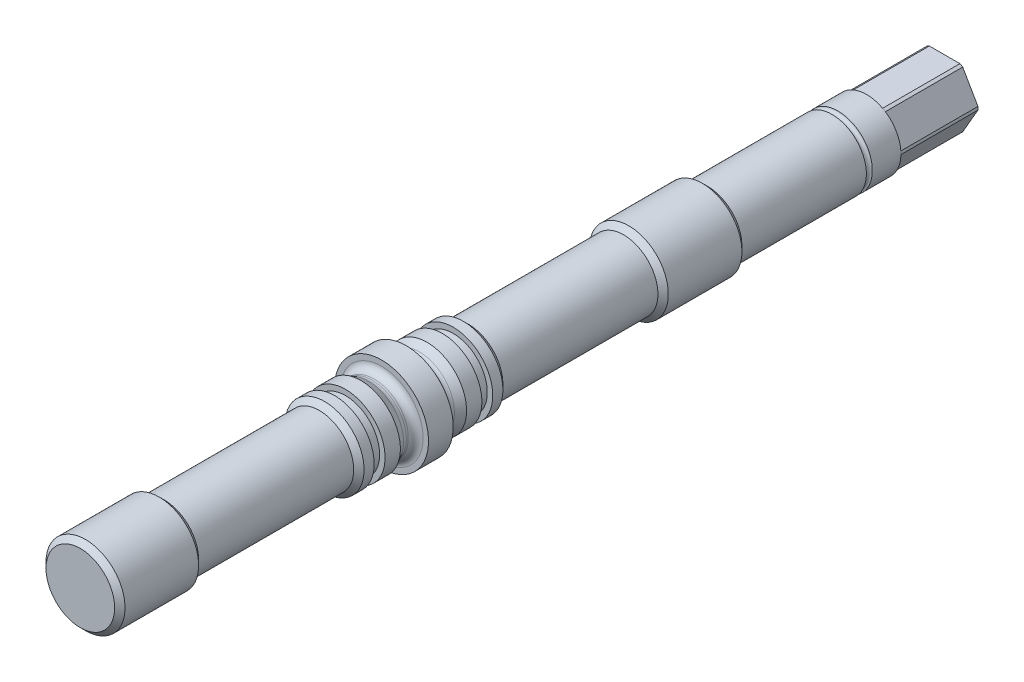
ISO-10303-21;
HEADER;
FILE_DESCRIPTION(('STEP AP214'),'2;1');
FILE_NAME('part.step','',(''),(''),'','','');
FILE_SCHEMA(('AUTOMOTIVE_DESIGN { 1 0 10303 214 1 1 1 1 }'));
ENDSEC;
DATA;
#1=APPLICATION_CONTEXT('core data for automotive mechanical design processes');
#2=APPLICATION_PROTOCOL_DEFINITION('international standard','automotive_design',2000,#1);
#3=PRODUCT_CONTEXT('',#1,'mechanical');
#4=PRODUCT('Part','Part','',(#3));
#5=PRODUCT_RELATED_PRODUCT_CATEGORY('part','',(#4));
#6=PRODUCT_DEFINITION_FORMATION('','',#4);
#7=PRODUCT_DEFINITION_CONTEXT('part definition',#1,'design');
#8=PRODUCT_DEFINITION('design','',#6,#7);
#9=PRODUCT_DEFINITION_SHAPE('','',#8);
#10=(LENGTH_UNIT() NAMED_UNIT(*) SI_UNIT(.MILLI.,.METRE.));
#11=(NAMED_UNIT(*) PLANE_ANGLE_UNIT() SI_UNIT($,.RADIAN.));
#12=(NAMED_UNIT(*) SI_UNIT($,.STERADIAN.) SOLID_ANGLE_UNIT());
#13=UNCERTAINTY_MEASURE_WITH_UNIT(LENGTH_MEASURE(1.E-05),#10,'distance_accuracy_value','');
#14=(GEOMETRIC_REPRESENTATION_CONTEXT(3) GLOBAL_UNCERTAINTY_ASSIGNED_CONTEXT((#13)) GLOBAL_UNIT_ASSIGNED_CONTEXT((#10,
#11,#12)) REPRESENTATION_CONTEXT('',''));
#15=CARTESIAN_POINT('',(0.,0.,0.));
#16=DIRECTION('',(0.,0.,1.));
#17=DIRECTION('',(1.,0.,0.));
#18=AXIS2_PLACEMENT_3D('',#15,#16,#17);
#19=CARTESIAN_POINT('',(0.,0.,-106.478312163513));
#20=DIRECTION('',(0.,0.,-1.));
#21=DIRECTION('',(-1.,0.,0.));
#22=AXIS2_PLACEMENT_3D('',#19,#20,#21);
#23=CYLINDRICAL_SURFACE('',#22,6.75);
#24=DIRECTION('',(0.,0.,-1.));
#25=VECTOR('',#24,1.);
#26=CARTESIAN_POINT('',(-3.09232921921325,-6.,-106.478312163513));
#27=LINE('',#26,#25);
#28=CARTESIAN_POINT('',(-3.09232921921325,-6.,-95.7));
#29=VERTEX_POINT('',#28);
#30=CARTESIAN_POINT('',(-3.09232921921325,-6.,-111.5));
#31=VERTEX_POINT('',#30);
#32=EDGE_CURVE('E294',#29,#31,#27,.T.);
#33=ORIENTED_EDGE('',*,*,#32,.F.);
#34=CARTESIAN_POINT('',(0.,0.,-95.7));
#35=DIRECTION('',(0.,0.,-1.));
#36=DIRECTION('',(-1.,0.,0.));
#37=AXIS2_PLACEMENT_3D('',#34,#35,#36);
#38=CIRCLE('',#37,6.75);
#39=CARTESIAN_POINT('',(-3.64998781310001,-5.67803566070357,-95.7));
#40=VERTEX_POINT('',#39);
#41=EDGE_CURVE('E122',#29,#40,#38,.T.);
#42=ORIENTED_EDGE('',*,*,#41,.T.);
#43=DIRECTION('',(0.,0.,-1.));
#44=VECTOR('',#43,1.);
#45=CARTESIAN_POINT('',(-3.64998781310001,-5.67803566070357,-106.478312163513));
#46=LINE('',#45,#44);
#47=CARTESIAN_POINT('',(-3.64998781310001,-5.67803566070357,-111.5));
#48=VERTEX_POINT('',#47);
#49=EDGE_CURVE('E107',#48,#40,#46,.F.);
#50=ORIENTED_EDGE('',*,*,#49,.F.);
#51=CARTESIAN_POINT('',(0.,0.,-111.5));
#52=DIRECTION('',(0.,0.,-1.));
#53=DIRECTION('',(-1.,0.,0.));
#54=AXIS2_PLACEMENT_3D('',#51,#52,#53);
#55=CIRCLE('',#54,6.75);
#56=EDGE_CURVE('E120',#31,#48,#55,.T.);
#57=ORIENTED_EDGE('',*,*,#56,.F.);
#58=EDGE_LOOP('',(#33,#42,#50,#57));
#59=FACE_BOUND('',#58,.T.);
#60=ADVANCED_FACE('F16',(#59),#23,.T.);
#61=DIRECTION('',(0.,0.,-1.));
#62=VECTOR('',#61,1.);
#63=CARTESIAN_POINT('',(3.09232921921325,-6.,-106.478312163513));
#64=LINE('',#63,#62);
#65=CARTESIAN_POINT('',(3.09232921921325,-6.,-111.5));
#66=VERTEX_POINT('',#65);
#67=CARTESIAN_POINT('',(3.09232921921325,-6.,-95.7));
#68=VERTEX_POINT('',#67);
#69=EDGE_CURVE('E292',#66,#68,#64,.F.);
#70=ORIENTED_EDGE('',*,*,#69,.F.);
#71=CARTESIAN_POINT('',(3.64998781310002,-5.67803566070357,-111.5));
#72=VERTEX_POINT('',#71);
#73=EDGE_CURVE('E128',#72,#66,#55,.T.);
#74=ORIENTED_EDGE('',*,*,#73,.F.);
#75=DIRECTION('',(0.,0.,-1.));
#76=VECTOR('',#75,1.);
#77=CARTESIAN_POINT('',(3.64998781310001,-5.67803566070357,-106.478312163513));
#78=LINE('',#77,#76);
#79=CARTESIAN_POINT('',(3.64998781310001,-5.67803566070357,-95.7));
#80=VERTEX_POINT('',#79);
#81=EDGE_CURVE('E259',#80,#72,#78,.T.);
#82=ORIENTED_EDGE('',*,*,#81,.F.);
#83=EDGE_CURVE('E840',#80,#68,#38,.T.);
#84=ORIENTED_EDGE('',*,*,#83,.T.);
#85=EDGE_LOOP('',(#70,#74,#82,#84));
#86=FACE_BOUND('',#85,.T.);
#87=ADVANCED_FACE('F323',(#86),#23,.T.);
#88=DIRECTION('',(0.,0.,-1.));
#89=VECTOR('',#88,1.);
#90=CARTESIAN_POINT('',(6.74231703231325,-0.321964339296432,-106.478312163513));
#91=LINE('',#90,#89);
#92=CARTESIAN_POINT('',(6.74231703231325,-0.321964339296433,-111.5));
#93=VERTEX_POINT('',#92);
#94=CARTESIAN_POINT('',(6.74231703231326,-0.321964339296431,-95.7));
#95=VERTEX_POINT('',#94);
#96=EDGE_CURVE('E256',#93,#95,#91,.F.);
#97=ORIENTED_EDGE('',*,*,#96,.F.);
#98=CARTESIAN_POINT('',(6.74231703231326,0.321964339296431,-111.5));
#99=VERTEX_POINT('',#98);
#100=EDGE_CURVE('E131',#99,#93,#55,.T.);
#101=ORIENTED_EDGE('',*,*,#100,.F.);
#102=DIRECTION('',(0.,0.,-1.));
#103=VECTOR('',#102,1.);
#104=CARTESIAN_POINT('',(6.74231703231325,0.321964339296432,-106.478312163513));
#105=LINE('',#104,#103);
#106=CARTESIAN_POINT('',(6.74231703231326,0.321964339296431,-95.7));
#107=VERTEX_POINT('',#106);
#108=EDGE_CURVE('E269',#107,#99,#105,.T.);
#109=ORIENTED_EDGE('',*,*,#108,.F.);
#110=EDGE_CURVE('E268',#107,#95,#38,.T.);
#111=ORIENTED_EDGE('',*,*,#110,.T.);
#112=EDGE_LOOP('',(#97,#101,#109,#111));
#113=FACE_BOUND('',#112,.T.);
#114=ADVANCED_FACE('F265',(#113),#23,.T.);
#115=DIRECTION('',(0.,0.,-1.));
#116=VECTOR('',#115,1.);
#117=CARTESIAN_POINT('',(3.64998781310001,5.67803566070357,-106.478312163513));
#118=LINE('',#117,#116);
#119=CARTESIAN_POINT('',(3.64998781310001,5.67803566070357,-111.5));
#120=VERTEX_POINT('',#119);
#121=CARTESIAN_POINT('',(3.64998781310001,5.67803566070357,-95.7));
#122=VERTEX_POINT('',#121);
#123=EDGE_CURVE('E282',#120,#122,#118,.F.);
#124=ORIENTED_EDGE('',*,*,#123,.F.);
#125=CARTESIAN_POINT('',(3.09232921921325,6.,-111.5));
#126=VERTEX_POINT('',#125);
#127=EDGE_CURVE('E137',#126,#120,#55,.T.);
#128=ORIENTED_EDGE('',*,*,#127,.F.);
#129=DIRECTION('',(0.,0.,-1.));
#130=VECTOR('',#129,1.);
#131=CARTESIAN_POINT('',(3.09232921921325,6.,-106.478312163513));
#132=LINE('',#131,#130);
#133=CARTESIAN_POINT('',(3.09232921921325,6.,-95.7));
#134=VERTEX_POINT('',#133);
#135=EDGE_CURVE('E280',#134,#126,#132,.T.);
#136=ORIENTED_EDGE('',*,*,#135,.F.);
#137=EDGE_CURVE('E143',#134,#122,#38,.T.);
#138=ORIENTED_EDGE('',*,*,#137,.T.);
#139=EDGE_LOOP('',(#124,#128,#136,#138));
#140=FACE_BOUND('',#139,.T.);
#141=ADVANCED_FACE('F278',(#140),#23,.T.);
#142=DIRECTION('',(0.,0.,-1.));
#143=VECTOR('',#142,1.);
#144=CARTESIAN_POINT('',(-3.09232921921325,6.,-106.478312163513));
#145=LINE('',#144,#143);
#146=CARTESIAN_POINT('',(-3.09232921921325,6.,-111.5));
#147=VERTEX_POINT('',#146);
#148=CARTESIAN_POINT('',(-3.09232921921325,6.,-95.7));
#149=VERTEX_POINT('',#148);
#150=EDGE_CURVE('E287',#147,#149,#145,.F.);
#151=ORIENTED_EDGE('',*,*,#150,.F.);
#152=CARTESIAN_POINT('',(-3.64998781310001,5.67803566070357,-111.5));
#153=VERTEX_POINT('',#152);
#154=EDGE_CURVE('E132',#153,#147,#55,.T.);
#155=ORIENTED_EDGE('',*,*,#154,.F.);
#156=DIRECTION('',(0.,0.,-1.));
#157=VECTOR('',#156,1.);
#158=CARTESIAN_POINT('',(-3.64998781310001,5.67803566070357,-106.478312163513));
#159=LINE('',#158,#157);
#160=CARTESIAN_POINT('',(-3.64998781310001,5.67803566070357,-95.7));
#161=VERTEX_POINT('',#160);
#162=EDGE_CURVE('E31',#161,#153,#159,.T.);
#163=ORIENTED_EDGE('',*,*,#162,.F.);
#164=EDGE_CURVE('E139',#161,#149,#38,.T.);
#165=ORIENTED_EDGE('',*,*,#164,.T.);
#166=EDGE_LOOP('',(#151,#155,#163,#165));
#167=FACE_BOUND('',#166,.T.);
#168=ADVANCED_FACE('F318',(#167),#23,.T.);
#169=DIRECTION('',(0.,0.,-1.));
#170=VECTOR('',#169,1.);
#171=CARTESIAN_POINT('',(-6.74231703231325,0.321964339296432,-106.478312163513));
#172=LINE('',#171,#170);
#173=CARTESIAN_POINT('',(-6.74231703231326,0.321964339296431,-111.5));
#174=VERTEX_POINT('',#173);
#175=CARTESIAN_POINT('',(-6.74231703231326,0.321964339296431,-95.7));
#176=VERTEX_POINT('',#175);
#177=EDGE_CURVE('E821',#174,#176,#172,.F.);
#178=ORIENTED_EDGE('',*,*,#177,.F.);
#179=CARTESIAN_POINT('',(-6.74231703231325,-0.321964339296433,-111.5));
#180=VERTEX_POINT('',#179);
#181=EDGE_CURVE('E129',#180,#174,#55,.T.);
#182=ORIENTED_EDGE('',*,*,#181,.F.);
#183=DIRECTION('',(0.,0.,-1.));
#184=VECTOR('',#183,1.);
#185=CARTESIAN_POINT('',(-6.74231703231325,-0.321964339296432,-106.478312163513));
#186=LINE('',#185,#184);
#187=CARTESIAN_POINT('',(-6.74231703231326,-0.321964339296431,-95.7));
#188=VERTEX_POINT('',#187);
#189=EDGE_CURVE('E39',#188,#180,#186,.T.);
#190=ORIENTED_EDGE('',*,*,#189,.F.);
#191=EDGE_CURVE('E142',#188,#176,#38,.T.);
#192=ORIENTED_EDGE('',*,*,#191,.T.);
#193=EDGE_LOOP('',(#178,#182,#190,#192));
#194=FACE_BOUND('',#193,.T.);
#195=ADVANCED_FACE('F308',(#194),#23,.T.);
#196=CARTESIAN_POINT('',(0.,6.75,-111.5));
#197=DIRECTION('',(0.,0.,1.));
#198=DIRECTION('',(1.,0.,0.));
#199=AXIS2_PLACEMENT_3D('',#196,#197,#198);
#200=PLANE('',#199);
#201=CARTESIAN_POINT('',(0.,0.,-111.5));
#202=DIRECTION('',(0.,0.,-1.));
#203=DIRECTION('',(-1.,0.,0.));
#204=AXIS2_PLACEMENT_3D('',#201,#202,#203);
#205=CIRCLE('',#204,2.635);
#206=CARTESIAN_POINT('',(-2.635,0.,-111.5));
#207=VERTEX_POINT('',#206);
#208=EDGE_CURVE('E136',#207,#207,#205,.T.);
#209=ORIENTED_EDGE('',*,*,#208,.F.);
#210=EDGE_LOOP('',(#209));
#211=FACE_BOUND('',#210,.T.);
#212=DIRECTION('',(1.,0.,0.));
#213=VECTOR('',#212,1.);
#214=CARTESIAN_POINT('',(0.,-6.,-111.5));
#215=LINE('',#214,#213);
#216=EDGE_CURVE('E11',#31,#66,#215,.T.);
#217=ORIENTED_EDGE('',*,*,#216,.F.);
#218=ORIENTED_EDGE('',*,*,#56,.T.);
#219=DIRECTION('',(0.5,-0.866025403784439,0.));
#220=VECTOR('',#219,1.);
#221=CARTESIAN_POINT('',(-8.11898816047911,2.0625,-111.5));
#222=LINE('',#221,#220);
#223=EDGE_CURVE('E104',#180,#48,#222,.T.);
#224=ORIENTED_EDGE('',*,*,#223,.F.);
#225=ORIENTED_EDGE('',*,*,#181,.T.);
#226=DIRECTION('',(-0.5,-0.866025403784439,0.));
#227=VECTOR('',#226,1.);
#228=CARTESIAN_POINT('',(-2.27331668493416,8.0625,-111.5));
#229=LINE('',#228,#227);
#230=EDGE_CURVE('E113',#153,#174,#229,.T.);
#231=ORIENTED_EDGE('',*,*,#230,.F.);
#232=ORIENTED_EDGE('',*,*,#154,.T.);
#233=DIRECTION('',(-1.,0.,0.));
#234=VECTOR('',#233,1.);
#235=CARTESIAN_POINT('',(0.,6.,-111.5));
#236=LINE('',#235,#234);
#237=EDGE_CURVE('E249',#126,#147,#236,.T.);
#238=ORIENTED_EDGE('',*,*,#237,.F.);
#239=ORIENTED_EDGE('',*,*,#127,.T.);
#240=DIRECTION('',(-0.5,0.866025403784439,0.));
#241=VECTOR('',#240,1.);
#242=CARTESIAN_POINT('',(2.27331668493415,8.0625,-111.5));
#243=LINE('',#242,#241);
#244=EDGE_CURVE('E251',#99,#120,#243,.T.);
#245=ORIENTED_EDGE('',*,*,#244,.F.);
#246=ORIENTED_EDGE('',*,*,#100,.T.);
#247=DIRECTION('',(0.5,0.866025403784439,0.));
#248=VECTOR('',#247,1.);
#249=CARTESIAN_POINT('',(8.11898816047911,2.0625,-111.5));
#250=LINE('',#249,#248);
#251=EDGE_CURVE('E24',#72,#93,#250,.T.);
#252=ORIENTED_EDGE('',*,*,#251,.F.);
#253=ORIENTED_EDGE('',*,*,#73,.T.);
#254=EDGE_LOOP('',(#217,#218,#224,#225,#231,#232,#238,#239,#245,#246,#252,#253));
#255=FACE_BOUND('',#254,.T.);
#256=ADVANCED_FACE('F126',(#211,#255),#200,.F.);
#257=CARTESIAN_POINT('',(0.,0.,63.5));
#258=DIRECTION('',(0.,0.,-1.));
#259=DIRECTION('',(-1.,0.,0.));
#260=AXIS2_PLACEMENT_3D('',#257,#258,#259);
#261=PLANE('',#260);
#262=CARTESIAN_POINT('',(0.,0.,63.5));
#263=DIRECTION('',(0.,0.,-1.));
#264=DIRECTION('',(-1.,0.,0.));
#265=AXIS2_PLACEMENT_3D('',#262,#263,#264);
#266=CIRCLE('',#265,6.95);
#267=CARTESIAN_POINT('',(-6.95,0.,63.5));
#268=VERTEX_POINT('',#267);
#269=EDGE_CURVE('E114',#268,#268,#266,.T.);
#270=ORIENTED_EDGE('',*,*,#269,.F.);
#271=EDGE_LOOP('',(#270));
#272=FACE_BOUND('',#271,.T.);
#273=ADVANCED_FACE('F18',(#272),#261,.F.);
#274=CARTESIAN_POINT('',(0.,0.,63.5));
#275=DIRECTION('',(0.,0.,-1.));
#276=DIRECTION('',(-1.,0.,0.));
#277=AXIS2_PLACEMENT_3D('',#274,#275,#276);
#278=CONICAL_SURFACE('',#277,6.95,0.78539816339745);
#279=CARTESIAN_POINT('',(0.,0.,62.45));
#280=DIRECTION('',(0.,0.,-1.));
#281=DIRECTION('',(-1.,0.,0.));
#282=AXIS2_PLACEMENT_3D('',#279,#280,#281);
#283=CIRCLE('',#282,8.);
#284=CARTESIAN_POINT('',(-8.,0.,62.45));
#285=VERTEX_POINT('',#284);
#286=EDGE_CURVE('E243',#285,#285,#283,.T.);
#287=ORIENTED_EDGE('',*,*,#286,.F.);
#288=EDGE_LOOP('',(#287));
#289=FACE_BOUND('',#288,.T.);
#290=ORIENTED_EDGE('',*,*,#269,.T.);
#291=EDGE_LOOP('',(#290));
#292=FACE_BOUND('',#291,.T.);
#293=ADVANCED_FACE('F316',(#289,#292),#278,.T.);
#294=CARTESIAN_POINT('',(0.,0.,-106.478312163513));
#295=DIRECTION('',(0.,0.,-1.));
#296=DIRECTION('',(-1.,0.,0.));
#297=AXIS2_PLACEMENT_3D('',#294,#295,#296);
#298=CYLINDRICAL_SURFACE('',#297,8.);
#299=CARTESIAN_POINT('',(0.,0.,47.55));
#300=DIRECTION('',(0.,0.,-1.));
#301=DIRECTION('',(-1.,0.,0.));
#302=AXIS2_PLACEMENT_3D('',#299,#300,#301);
#303=CIRCLE('',#302,8.);
#304=CARTESIAN_POINT('',(-8.,0.,47.55));
#305=VERTEX_POINT('',#304);
#306=EDGE_CURVE('E240',#305,#305,#303,.T.);
#307=ORIENTED_EDGE('',*,*,#306,.F.);
#308=EDGE_LOOP('',(#307));
#309=FACE_BOUND('',#308,.T.);
#310=ORIENTED_EDGE('',*,*,#286,.T.);
#311=EDGE_LOOP('',(#310));
#312=FACE_BOUND('',#311,.T.);
#313=ADVANCED_FACE('F461',(#309,#312),#298,.T.);
#314=CARTESIAN_POINT('',(0.,0.,47.55));
#315=DIRECTION('',(0.,0.,1.));
#316=DIRECTION('',(1.,0.,0.));
#317=AXIS2_PLACEMENT_3D('',#314,#315,#316);
#318=CONICAL_SURFACE('',#317,8.,0.78539816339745);
#319=CARTESIAN_POINT('',(0.,0.,46.5));
#320=DIRECTION('',(0.,0.,-1.));
#321=DIRECTION('',(-1.,0.,0.));
#322=AXIS2_PLACEMENT_3D('',#319,#320,#321);
#323=CIRCLE('',#322,6.95);
#324=CARTESIAN_POINT('',(-6.95,0.,46.5));
#325=VERTEX_POINT('',#324);
#326=EDGE_CURVE('E237',#325,#325,#323,.T.);
#327=ORIENTED_EDGE('',*,*,#326,.F.);
#328=EDGE_LOOP('',(#327));
#329=FACE_BOUND('',#328,.T.);
#330=ORIENTED_EDGE('',*,*,#306,.T.);
#331=EDGE_LOOP('',(#330));
#332=FACE_BOUND('',#331,.T.);
#333=ADVANCED_FACE('F457',(#329,#332),#318,.T.);
#334=CARTESIAN_POINT('',(0.,0.,-106.478312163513));
#335=DIRECTION('',(0.,0.,-1.));
#336=DIRECTION('',(-1.,0.,0.));
#337=AXIS2_PLACEMENT_3D('',#334,#335,#336);
#338=CYLINDRICAL_SURFACE('',#337,6.95);
#339=CARTESIAN_POINT('',(0.,0.,15.1));
#340=DIRECTION('',(0.,0.,-1.));
#341=DIRECTION('',(-1.,0.,0.));
#342=AXIS2_PLACEMENT_3D('',#339,#340,#341);
#343=CIRCLE('',#342,6.95);
#344=CARTESIAN_POINT('',(-6.95,0.,15.1));
#345=VERTEX_POINT('',#344);
#346=EDGE_CURVE('E234',#345,#345,#343,.T.);
#347=ORIENTED_EDGE('',*,*,#346,.F.);
#348=EDGE_LOOP('',(#347));
#349=FACE_BOUND('',#348,.T.);
#350=ORIENTED_EDGE('',*,*,#326,.T.);
#351=EDGE_LOOP('',(#350));
#352=FACE_BOUND('',#351,.T.);
#353=ADVANCED_FACE('F453',(#349,#352),#338,.T.);
#354=CARTESIAN_POINT('',(0.,0.,15.1));
#355=DIRECTION('',(0.,0.,-1.));
#356=DIRECTION('',(-1.,0.,0.));
#357=AXIS2_PLACEMENT_3D('',#354,#355,#356);
#358=CONICAL_SURFACE('',#357,6.95,0.785398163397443);
#359=CARTESIAN_POINT('',(0.,0.,14.05));
#360=DIRECTION('',(0.,0.,-1.));
#361=DIRECTION('',(-1.,0.,0.));
#362=AXIS2_PLACEMENT_3D('',#359,#360,#361);
#363=CIRCLE('',#362,8.);
#364=CARTESIAN_POINT('',(-8.,0.,14.05));
#365=VERTEX_POINT('',#364);
#366=EDGE_CURVE('E231',#365,#365,#363,.T.);
#367=ORIENTED_EDGE('',*,*,#366,.F.);
#368=EDGE_LOOP('',(#367));
#369=FACE_BOUND('',#368,.T.);
#370=ORIENTED_EDGE('',*,*,#346,.T.);
#371=EDGE_LOOP('',(#370));
#372=FACE_BOUND('',#371,.T.);
#373=ADVANCED_FACE('F449',(#369,#372),#358,.T.);
#374=CARTESIAN_POINT('',(0.,0.,-106.478312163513));
#375=DIRECTION('',(0.,0.,-1.));
#376=DIRECTION('',(-1.,0.,0.));
#377=AXIS2_PLACEMENT_3D('',#374,#375,#376);
#378=CYLINDRICAL_SURFACE('',#377,8.);
#379=CARTESIAN_POINT('',(0.,0.,12.));
#380=DIRECTION('',(0.,0.,-1.));
#381=DIRECTION('',(-1.,0.,0.));
#382=AXIS2_PLACEMENT_3D('',#379,#380,#381);
#383=CIRCLE('',#382,8.);
#384=CARTESIAN_POINT('',(-8.,0.,12.));
#385=VERTEX_POINT('',#384);
#386=EDGE_CURVE('E228',#385,#385,#383,.T.);
#387=ORIENTED_EDGE('',*,*,#386,.F.);
#388=EDGE_LOOP('',(#387));
#389=FACE_BOUND('',#388,.T.);
#390=ORIENTED_EDGE('',*,*,#366,.T.);
#391=EDGE_LOOP('',(#390));
#392=FACE_BOUND('',#391,.T.);
#393=ADVANCED_FACE('F445',(#389,#392),#378,.T.);
#394=CARTESIAN_POINT('',(0.,8.,12.));
#395=DIRECTION('',(0.,0.,1.));
#396=DIRECTION('',(1.,0.,0.));
#397=AXIS2_PLACEMENT_3D('',#394,#395,#396);
#398=PLANE('',#397);
#399=CARTESIAN_POINT('',(0.,0.,12.));
#400=DIRECTION('',(0.,0.,-1.));
#401=DIRECTION('',(-1.,0.,0.));
#402=AXIS2_PLACEMENT_3D('',#399,#400,#401);
#403=CIRCLE('',#402,6.9);
#404=CARTESIAN_POINT('',(-6.9,0.,12.));
#405=VERTEX_POINT('',#404);
#406=EDGE_CURVE('E225',#405,#405,#403,.T.);
#407=ORIENTED_EDGE('',*,*,#406,.F.);
#408=EDGE_LOOP('',(#407));
#409=FACE_BOUND('',#408,.T.);
#410=ORIENTED_EDGE('',*,*,#386,.T.);
#411=EDGE_LOOP('',(#410));
#412=FACE_BOUND('',#411,.T.);
#413=ADVANCED_FACE('F441',(#409,#412),#398,.F.);
#414=CARTESIAN_POINT('',(0.,0.,-106.478312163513));
#415=DIRECTION('',(0.,0.,-1.));
#416=DIRECTION('',(-1.,0.,0.));
#417=AXIS2_PLACEMENT_3D('',#414,#415,#416);
#418=CYLINDRICAL_SURFACE('',#417,6.9);
#419=CARTESIAN_POINT('',(0.,0.,9.8));
#420=DIRECTION('',(0.,0.,-1.));
#421=DIRECTION('',(-1.,0.,0.));
#422=AXIS2_PLACEMENT_3D('',#419,#420,#421);
#423=CIRCLE('',#422,6.9);
#424=CARTESIAN_POINT('',(-6.9,0.,9.8));
#425=VERTEX_POINT('',#424);
#426=EDGE_CURVE('E222',#425,#425,#423,.T.);
#427=ORIENTED_EDGE('',*,*,#426,.F.);
#428=EDGE_LOOP('',(#427));
#429=FACE_BOUND('',#428,.T.);
#430=ORIENTED_EDGE('',*,*,#406,.T.);
#431=EDGE_LOOP('',(#430));
#432=FACE_BOUND('',#431,.T.);
#433=ADVANCED_FACE('F437',(#429,#432),#418,.T.);
#434=CARTESIAN_POINT('',(0.,6.9,9.8));
#435=DIRECTION('',(0.,0.,-1.));
#436=DIRECTION('',(-1.,0.,0.));
#437=AXIS2_PLACEMENT_3D('',#434,#435,#436);
#438=PLANE('',#437);
#439=CARTESIAN_POINT('',(0.,0.,9.8));
#440=DIRECTION('',(0.,0.,-1.));
#441=DIRECTION('',(-1.,0.,0.));
#442=AXIS2_PLACEMENT_3D('',#439,#440,#441);
#443=CIRCLE('',#442,8.);
#444=CARTESIAN_POINT('',(-8.,0.,9.8));
#445=VERTEX_POINT('',#444);
#446=EDGE_CURVE('E219',#445,#445,#443,.T.);
#447=ORIENTED_EDGE('',*,*,#446,.F.);
#448=EDGE_LOOP('',(#447));
#449=FACE_BOUND('',#448,.T.);
#450=ORIENTED_EDGE('',*,*,#426,.T.);
#451=EDGE_LOOP('',(#450));
#452=FACE_BOUND('',#451,.T.);
#453=ADVANCED_FACE('F433',(#449,#452),#438,.F.);
#454=CARTESIAN_POINT('',(0.,0.,-106.478312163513));
#455=DIRECTION('',(0.,0.,-1.));
#456=DIRECTION('',(-1.,0.,0.));
#457=AXIS2_PLACEMENT_3D('',#454,#455,#456);
#458=CYLINDRICAL_SURFACE('',#457,8.);
#459=CARTESIAN_POINT('',(0.,0.,6.7));
#460=DIRECTION('',(0.,0.,-1.));
#461=DIRECTION('',(-1.,0.,0.));
#462=AXIS2_PLACEMENT_3D('',#459,#460,#461);
#463=CIRCLE('',#462,8.);
#464=CARTESIAN_POINT('',(-8.,0.,6.7));
#465=VERTEX_POINT('',#464);
#466=EDGE_CURVE('E216',#465,#465,#463,.T.);
#467=ORIENTED_EDGE('',*,*,#466,.F.);
#468=EDGE_LOOP('',(#467));
#469=FACE_BOUND('',#468,.T.);
#470=ORIENTED_EDGE('',*,*,#446,.T.);
#471=EDGE_LOOP('',(#470));
#472=FACE_BOUND('',#471,.T.);
#473=ADVANCED_FACE('F429',(#469,#472),#458,.T.);
#474=CARTESIAN_POINT('',(0.,0.,6.7));
#475=DIRECTION('',(0.,0.,1.));
#476=DIRECTION('',(1.,0.,0.));
#477=AXIS2_PLACEMENT_3D('',#474,#475,#476);
#478=CONICAL_SURFACE('',#477,8.,0.523598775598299);
#479=CARTESIAN_POINT('',(0.,0.,5.14282032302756));
#480=DIRECTION('',(0.,0.,-1.));
#481=DIRECTION('',(-1.,0.,0.));
#482=AXIS2_PLACEMENT_3D('',#479,#480,#481);
#483=CIRCLE('',#482,7.10096189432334);
#484=CARTESIAN_POINT('',(-7.10096189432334,0.,5.14282032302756));
#485=VERTEX_POINT('',#484);
#486=EDGE_CURVE('E213',#485,#485,#483,.T.);
#487=ORIENTED_EDGE('',*,*,#486,.F.);
#488=EDGE_LOOP('',(#487));
#489=FACE_BOUND('',#488,.T.);
#490=ORIENTED_EDGE('',*,*,#466,.T.);
#491=EDGE_LOOP('',(#490));
#492=FACE_BOUND('',#491,.T.);
#493=ADVANCED_FACE('F425',(#489,#492),#478,.T.);
#494=CARTESIAN_POINT('',(0.,0.,4.39282032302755));
#495=DIRECTION('',(0.,0.,-1.));
#496=DIRECTION('',(-1.,0.,0.));
#497=AXIS2_PLACEMENT_3D('',#494,#495,#496);
#498=TOROIDAL_SURFACE('',#497,8.4,1.5);
#499=CARTESIAN_POINT('',(0.,0.,4.39282032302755));
#500=DIRECTION('',(0.,0.,-1.));
#501=DIRECTION('',(-1.,0.,0.));
#502=AXIS2_PLACEMENT_3D('',#499,#500,#501);
#503=CIRCLE('',#502,6.9);
#504=CARTESIAN_POINT('',(-6.9,0.,4.39282032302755));
#505=VERTEX_POINT('',#504);
#506=EDGE_CURVE('E210',#505,#505,#503,.T.);
#507=ORIENTED_EDGE('',*,*,#506,.F.);
#508=EDGE_LOOP('',(#507));
#509=FACE_BOUND('',#508,.T.);
#510=ORIENTED_EDGE('',*,*,#486,.T.);
#511=EDGE_LOOP('',(#510));
#512=FACE_BOUND('',#511,.T.);
#513=ADVANCED_FACE('F421',(#509,#512),#498,.F.);
#514=CARTESIAN_POINT('',(0.,0.,-106.478312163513));
#515=DIRECTION('',(0.,0.,-1.));
#516=DIRECTION('',(-1.,0.,0.));
#517=AXIS2_PLACEMENT_3D('',#514,#515,#516);
#518=CYLINDRICAL_SURFACE('',#517,6.9);
#519=CARTESIAN_POINT('',(0.,0.,4.));
#520=DIRECTION('',(0.,0.,-1.));
#521=DIRECTION('',(-1.,0.,0.));
#522=AXIS2_PLACEMENT_3D('',#519,#520,#521);
#523=CIRCLE('',#522,6.9);
#524=CARTESIAN_POINT('',(-6.9,0.,4.));
#525=VERTEX_POINT('',#524);
#526=EDGE_CURVE('E207',#525,#525,#523,.T.);
#527=ORIENTED_EDGE('',*,*,#526,.F.);
#528=EDGE_LOOP('',(#527));
#529=FACE_BOUND('',#528,.T.);
#530=ORIENTED_EDGE('',*,*,#506,.T.);
#531=EDGE_LOOP('',(#530));
#532=FACE_BOUND('',#531,.T.);
#533=ADVANCED_FACE('F417',(#529,#532),#518,.T.);
#534=CARTESIAN_POINT('',(0.,0.,4.));
#535=DIRECTION('',(0.,0.,-1.));
#536=DIRECTION('',(-1.,0.,0.));
#537=AXIS2_PLACEMENT_3D('',#534,#535,#536);
#538=TOROIDAL_SURFACE('',#537,8.4,1.5);
#539=CARTESIAN_POINT('',(0.,0.,2.5));
#540=DIRECTION('',(0.,0.,-1.));
#541=DIRECTION('',(-1.,0.,0.));
#542=AXIS2_PLACEMENT_3D('',#539,#540,#541);
#543=CIRCLE('',#542,8.4);
#544=CARTESIAN_POINT('',(-8.4,0.,2.5));
#545=VERTEX_POINT('',#544);
#546=EDGE_CURVE('E204',#545,#545,#543,.T.);
#547=ORIENTED_EDGE('',*,*,#546,.F.);
#548=EDGE_LOOP('',(#547));
#549=FACE_BOUND('',#548,.T.);
#550=ORIENTED_EDGE('',*,*,#526,.T.);
#551=EDGE_LOOP('',(#550));
#552=FACE_BOUND('',#551,.T.);
#553=ADVANCED_FACE('F413',(#549,#552),#538,.F.);
#554=CARTESIAN_POINT('',(0.,8.4,2.5));
#555=DIRECTION('',(0.,0.,-1.));
#556=DIRECTION('',(-1.,0.,0.));
#557=AXIS2_PLACEMENT_3D('',#554,#555,#556);
#558=PLANE('',#557);
#559=CARTESIAN_POINT('',(0.,0.,2.5));
#560=DIRECTION('',(0.,0.,-1.));
#561=DIRECTION('',(-1.,0.,0.));
#562=AXIS2_PLACEMENT_3D('',#559,#560,#561);
#563=CIRCLE('',#562,9.5);
#564=CARTESIAN_POINT('',(-9.5,0.,2.5));
#565=VERTEX_POINT('',#564);
#566=EDGE_CURVE('E201',#565,#565,#563,.T.);
#567=ORIENTED_EDGE('',*,*,#566,.F.);
#568=EDGE_LOOP('',(#567));
#569=FACE_BOUND('',#568,.T.);
#570=ORIENTED_EDGE('',*,*,#546,.T.);
#571=EDGE_LOOP('',(#570));
#572=FACE_BOUND('',#571,.T.);
#573=ADVANCED_FACE('F409',(#569,#572),#558,.F.);
#574=CARTESIAN_POINT('',(0.,0.,-106.478312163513));
#575=DIRECTION('',(0.,0.,-1.));
#576=DIRECTION('',(-1.,0.,0.));
#577=AXIS2_PLACEMENT_3D('',#574,#575,#576);
#578=CYLINDRICAL_SURFACE('',#577,9.5);
#579=CARTESIAN_POINT('',(0.,0.,-2.5));
#580=DIRECTION('',(0.,0.,-1.));
#581=DIRECTION('',(-1.,0.,0.));
#582=AXIS2_PLACEMENT_3D('',#579,#580,#581);
#583=CIRCLE('',#582,9.5);
#584=CARTESIAN_POINT('',(-9.5,0.,-2.5));
#585=VERTEX_POINT('',#584);
#586=EDGE_CURVE('E198',#585,#585,#583,.T.);
#587=ORIENTED_EDGE('',*,*,#586,.F.);
#588=EDGE_LOOP('',(#587));
#589=FACE_BOUND('',#588,.T.);
#590=ORIENTED_EDGE('',*,*,#566,.T.);
#591=EDGE_LOOP('',(#590));
#592=FACE_BOUND('',#591,.T.);
#593=ADVANCED_FACE('F405',(#589,#592),#578,.T.);
#594=CARTESIAN_POINT('',(0.,9.5,-2.5));
#595=DIRECTION('',(0.,0.,1.));
#596=DIRECTION('',(1.,0.,0.));
#597=AXIS2_PLACEMENT_3D('',#594,#595,#596);
#598=PLANE('',#597);
#599=CARTESIAN_POINT('',(0.,0.,-2.5));
#600=DIRECTION('',(0.,0.,-1.));
#601=DIRECTION('',(-1.,0.,0.));
#602=AXIS2_PLACEMENT_3D('',#599,#600,#601);
#603=CIRCLE('',#602,8.4);
#604=CARTESIAN_POINT('',(-8.4,0.,-2.5));
#605=VERTEX_POINT('',#604);
#606=EDGE_CURVE('E195',#605,#605,#603,.T.);
#607=ORIENTED_EDGE('',*,*,#606,.F.);
#608=EDGE_LOOP('',(#607));
#609=FACE_BOUND('',#608,.T.);
#610=ORIENTED_EDGE('',*,*,#586,.T.);
#611=EDGE_LOOP('',(#610));
#612=FACE_BOUND('',#611,.T.);
#613=ADVANCED_FACE('F401',(#609,#612),#598,.F.);
#614=CARTESIAN_POINT('',(0.,0.,-4.));
#615=DIRECTION('',(0.,0.,-1.));
#616=DIRECTION('',(-1.,0.,0.));
#617=AXIS2_PLACEMENT_3D('',#614,#615,#616);
#618=TOROIDAL_SURFACE('',#617,8.4,1.5);
#619=CARTESIAN_POINT('',(0.,0.,-4.));
#620=DIRECTION('',(0.,0.,-1.));
#621=DIRECTION('',(-1.,0.,0.));
#622=AXIS2_PLACEMENT_3D('',#619,#620,#621);
#623=CIRCLE('',#622,6.9);
#624=CARTESIAN_POINT('',(-6.9,0.,-4.));
#625=VERTEX_POINT('',#624);
#626=EDGE_CURVE('E192',#625,#625,#623,.T.);
#627=ORIENTED_EDGE('',*,*,#626,.F.);
#628=EDGE_LOOP('',(#627));
#629=FACE_BOUND('',#628,.T.);
#630=ORIENTED_EDGE('',*,*,#606,.T.);
#631=EDGE_LOOP('',(#630));
#632=FACE_BOUND('',#631,.T.);
#633=ADVANCED_FACE('F397',(#629,#632),#618,.F.);
#634=CARTESIAN_POINT('',(0.,0.,-106.478312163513));
#635=DIRECTION('',(0.,0.,-1.));
#636=DIRECTION('',(-1.,0.,0.));
#637=AXIS2_PLACEMENT_3D('',#634,#635,#636);
#638=CYLINDRICAL_SURFACE('',#637,6.9);
#639=CARTESIAN_POINT('',(0.,0.,-4.39282032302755));
#640=DIRECTION('',(0.,0.,-1.));
#641=DIRECTION('',(-1.,0.,0.));
#642=AXIS2_PLACEMENT_3D('',#639,#640,#641);
#643=CIRCLE('',#642,6.9);
#644=CARTESIAN_POINT('',(-6.9,0.,-4.39282032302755));
#645=VERTEX_POINT('',#644);
#646=EDGE_CURVE('E189',#645,#645,#643,.T.);
#647=ORIENTED_EDGE('',*,*,#646,.F.);
#648=EDGE_LOOP('',(#647));
#649=FACE_BOUND('',#648,.T.);
#650=ORIENTED_EDGE('',*,*,#626,.T.);
#651=EDGE_LOOP('',(#650));
#652=FACE_BOUND('',#651,.T.);
#653=ADVANCED_FACE('F393',(#649,#652),#638,.T.);
#654=CARTESIAN_POINT('',(0.,0.,-4.39282032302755));
#655=DIRECTION('',(0.,0.,-1.));
#656=DIRECTION('',(-1.,0.,0.));
#657=AXIS2_PLACEMENT_3D('',#654,#655,#656);
#658=TOROIDAL_SURFACE('',#657,8.4,1.5);
#659=CARTESIAN_POINT('',(0.,0.,-5.14282032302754));
#660=DIRECTION('',(0.,0.,-1.));
#661=DIRECTION('',(-1.,0.,0.));
#662=AXIS2_PLACEMENT_3D('',#659,#660,#661);
#663=CIRCLE('',#662,7.10096189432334);
#664=CARTESIAN_POINT('',(-7.10096189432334,0.,-5.14282032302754));
#665=VERTEX_POINT('',#664);
#666=EDGE_CURVE('E186',#665,#665,#663,.T.);
#667=ORIENTED_EDGE('',*,*,#666,.F.);
#668=EDGE_LOOP('',(#667));
#669=FACE_BOUND('',#668,.T.);
#670=ORIENTED_EDGE('',*,*,#646,.T.);
#671=EDGE_LOOP('',(#670));
#672=FACE_BOUND('',#671,.T.);
#673=ADVANCED_FACE('F389',(#669,#672),#658,.F.);
#674=CARTESIAN_POINT('',(0.,0.,-5.14282032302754));
#675=DIRECTION('',(0.,0.,-1.));
#676=DIRECTION('',(-1.,0.,0.));
#677=AXIS2_PLACEMENT_3D('',#674,#675,#676);
#678=CONICAL_SURFACE('',#677,7.10096189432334,0.523598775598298);
#679=CARTESIAN_POINT('',(0.,0.,-6.7));
#680=DIRECTION('',(0.,0.,-1.));
#681=DIRECTION('',(-1.,0.,0.));
#682=AXIS2_PLACEMENT_3D('',#679,#680,#681);
#683=CIRCLE('',#682,8.);
#684=CARTESIAN_POINT('',(-8.,0.,-6.7));
#685=VERTEX_POINT('',#684);
#686=EDGE_CURVE('E183',#685,#685,#683,.T.);
#687=ORIENTED_EDGE('',*,*,#686,.F.);
#688=EDGE_LOOP('',(#687));
#689=FACE_BOUND('',#688,.T.);
#690=ORIENTED_EDGE('',*,*,#666,.T.);
#691=EDGE_LOOP('',(#690));
#692=FACE_BOUND('',#691,.T.);
#693=ADVANCED_FACE('F385',(#689,#692),#678,.T.);
#694=CARTESIAN_POINT('',(0.,0.,-106.478312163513));
#695=DIRECTION('',(0.,0.,-1.));
#696=DIRECTION('',(-1.,0.,0.));
#697=AXIS2_PLACEMENT_3D('',#694,#695,#696);
#698=CYLINDRICAL_SURFACE('',#697,8.);
#699=CARTESIAN_POINT('',(0.,0.,-9.8));
#700=DIRECTION('',(0.,0.,-1.));
#701=DIRECTION('',(-1.,0.,0.));
#702=AXIS2_PLACEMENT_3D('',#699,#700,#701);
#703=CIRCLE('',#702,8.);
#704=CARTESIAN_POINT('',(-8.,0.,-9.8));
#705=VERTEX_POINT('',#704);
#706=EDGE_CURVE('E180',#705,#705,#703,.T.);
#707=ORIENTED_EDGE('',*,*,#706,.F.);
#708=EDGE_LOOP('',(#707));
#709=FACE_BOUND('',#708,.T.);
#710=ORIENTED_EDGE('',*,*,#686,.T.);
#711=EDGE_LOOP('',(#710));
#712=FACE_BOUND('',#711,.T.);
#713=ADVANCED_FACE('F381',(#709,#712),#698,.T.);
#714=CARTESIAN_POINT('',(0.,8.,-9.8));
#715=DIRECTION('',(0.,0.,1.));
#716=DIRECTION('',(1.,0.,0.));
#717=AXIS2_PLACEMENT_3D('',#714,#715,#716);
#718=PLANE('',#717);
#719=CARTESIAN_POINT('',(0.,0.,-9.8));
#720=DIRECTION('',(0.,0.,-1.));
#721=DIRECTION('',(-1.,0.,0.));
#722=AXIS2_PLACEMENT_3D('',#719,#720,#721);
#723=CIRCLE('',#722,6.9);
#724=CARTESIAN_POINT('',(-6.9,0.,-9.8));
#725=VERTEX_POINT('',#724);
#726=EDGE_CURVE('E177',#725,#725,#723,.T.);
#727=ORIENTED_EDGE('',*,*,#726,.F.);
#728=EDGE_LOOP('',(#727));
#729=FACE_BOUND('',#728,.T.);
#730=ORIENTED_EDGE('',*,*,#706,.T.);
#731=EDGE_LOOP('',(#730));
#732=FACE_BOUND('',#731,.T.);
#733=ADVANCED_FACE('F377',(#729,#732),#718,.F.);
#734=CARTESIAN_POINT('',(0.,0.,-106.478312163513));
#735=DIRECTION('',(0.,0.,-1.));
#736=DIRECTION('',(-1.,0.,0.));
#737=AXIS2_PLACEMENT_3D('',#734,#735,#736);
#738=CYLINDRICAL_SURFACE('',#737,6.9);
#739=CARTESIAN_POINT('',(0.,0.,-12.));
#740=DIRECTION('',(0.,0.,-1.));
#741=DIRECTION('',(-1.,0.,0.));
#742=AXIS2_PLACEMENT_3D('',#739,#740,#741);
#743=CIRCLE('',#742,6.9);
#744=CARTESIAN_POINT('',(-6.9,0.,-12.));
#745=VERTEX_POINT('',#744);
#746=EDGE_CURVE('E174',#745,#745,#743,.T.);
#747=ORIENTED_EDGE('',*,*,#746,.F.);
#748=EDGE_LOOP('',(#747));
#749=FACE_BOUND('',#748,.T.);
#750=ORIENTED_EDGE('',*,*,#726,.T.);
#751=EDGE_LOOP('',(#750));
#752=FACE_BOUND('',#751,.T.);
#753=ADVANCED_FACE('F373',(#749,#752),#738,.T.);
#754=CARTESIAN_POINT('',(0.,6.9,-12.));
#755=DIRECTION('',(0.,0.,-1.));
#756=DIRECTION('',(-1.,0.,0.));
#757=AXIS2_PLACEMENT_3D('',#754,#755,#756);
#758=PLANE('',#757);
#759=CARTESIAN_POINT('',(0.,0.,-12.));
#760=DIRECTION('',(0.,0.,-1.));
#761=DIRECTION('',(-1.,0.,0.));
#762=AXIS2_PLACEMENT_3D('',#759,#760,#761);
#763=CIRCLE('',#762,8.);
#764=CARTESIAN_POINT('',(-8.,0.,-12.));
#765=VERTEX_POINT('',#764);
#766=EDGE_CURVE('E171',#765,#765,#763,.T.);
#767=ORIENTED_EDGE('',*,*,#766,.F.);
#768=EDGE_LOOP('',(#767));
#769=FACE_BOUND('',#768,.T.);
#770=ORIENTED_EDGE('',*,*,#746,.T.);
#771=EDGE_LOOP('',(#770));
#772=FACE_BOUND('',#771,.T.);
#773=ADVANCED_FACE('F369',(#769,#772),#758,.F.);
#774=CARTESIAN_POINT('',(0.,0.,-106.478312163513));
#775=DIRECTION('',(0.,0.,-1.));
#776=DIRECTION('',(-1.,0.,0.));
#777=AXIS2_PLACEMENT_3D('',#774,#775,#776);
#778=CYLINDRICAL_SURFACE('',#777,8.);
#779=CARTESIAN_POINT('',(0.,0.,-14.05));
#780=DIRECTION('',(0.,0.,-1.));
#781=DIRECTION('',(-1.,0.,0.));
#782=AXIS2_PLACEMENT_3D('',#779,#780,#781);
#783=CIRCLE('',#782,8.);
#784=CARTESIAN_POINT('',(-8.,0.,-14.05));
#785=VERTEX_POINT('',#784);
#786=EDGE_CURVE('E168',#785,#785,#783,.T.);
#787=ORIENTED_EDGE('',*,*,#786,.F.);
#788=EDGE_LOOP('',(#787));
#789=FACE_BOUND('',#788,.T.);
#790=ORIENTED_EDGE('',*,*,#766,.T.);
#791=EDGE_LOOP('',(#790));
#792=FACE_BOUND('',#791,.T.);
#793=ADVANCED_FACE('F365',(#789,#792),#778,.T.);
#794=CARTESIAN_POINT('',(0.,0.,-14.05));
#795=DIRECTION('',(0.,0.,1.));
#796=DIRECTION('',(1.,0.,0.));
#797=AXIS2_PLACEMENT_3D('',#794,#795,#796);
#798=CONICAL_SURFACE('',#797,8.,0.785398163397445);
#799=CARTESIAN_POINT('',(0.,0.,-15.1));
#800=DIRECTION('',(0.,0.,-1.));
#801=DIRECTION('',(-1.,0.,0.));
#802=AXIS2_PLACEMENT_3D('',#799,#800,#801);
#803=CIRCLE('',#802,6.95);
#804=CARTESIAN_POINT('',(-6.95,0.,-15.1));
#805=VERTEX_POINT('',#804);
#806=EDGE_CURVE('E165',#805,#805,#803,.T.);
#807=ORIENTED_EDGE('',*,*,#806,.F.);
#808=EDGE_LOOP('',(#807));
#809=FACE_BOUND('',#808,.T.);
#810=ORIENTED_EDGE('',*,*,#786,.T.);
#811=EDGE_LOOP('',(#810));
#812=FACE_BOUND('',#811,.T.);
#813=ADVANCED_FACE('F361',(#809,#812),#798,.T.);
#814=CARTESIAN_POINT('',(0.,0.,-106.478312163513));
#815=DIRECTION('',(0.,0.,-1.));
#816=DIRECTION('',(-1.,0.,0.));
#817=AXIS2_PLACEMENT_3D('',#814,#815,#816);
#818=CYLINDRICAL_SURFACE('',#817,6.95);
#819=CARTESIAN_POINT('',(0.,0.,-46.5));
#820=DIRECTION('',(0.,0.,-1.));
#821=DIRECTION('',(-1.,0.,0.));
#822=AXIS2_PLACEMENT_3D('',#819,#820,#821);
#823=CIRCLE('',#822,6.95);
#824=CARTESIAN_POINT('',(-6.95,0.,-46.5));
#825=VERTEX_POINT('',#824);
#826=EDGE_CURVE('E162',#825,#825,#823,.T.);
#827=ORIENTED_EDGE('',*,*,#826,.F.);
#828=EDGE_LOOP('',(#827));
#829=FACE_BOUND('',#828,.T.);
#830=ORIENTED_EDGE('',*,*,#806,.T.);
#831=EDGE_LOOP('',(#830));
#832=FACE_BOUND('',#831,.T.);
#833=ADVANCED_FACE('F357',(#829,#832),#818,.T.);
#834=CARTESIAN_POINT('',(0.,0.,-46.5));
#835=DIRECTION('',(0.,0.,-1.));
#836=DIRECTION('',(-1.,0.,0.));
#837=AXIS2_PLACEMENT_3D('',#834,#835,#836);
#838=CONICAL_SURFACE('',#837,6.95,0.785398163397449);
#839=CARTESIAN_POINT('',(0.,0.,-47.55));
#840=DIRECTION('',(0.,0.,-1.));
#841=DIRECTION('',(-1.,0.,0.));
#842=AXIS2_PLACEMENT_3D('',#839,#840,#841);
#843=CIRCLE('',#842,8.);
#844=CARTESIAN_POINT('',(-8.,0.,-47.55));
#845=VERTEX_POINT('',#844);
#846=EDGE_CURVE('E159',#845,#845,#843,.T.);
#847=ORIENTED_EDGE('',*,*,#846,.F.);
#848=EDGE_LOOP('',(#847));
#849=FACE_BOUND('',#848,.T.);
#850=ORIENTED_EDGE('',*,*,#826,.T.);
#851=EDGE_LOOP('',(#850));
#852=FACE_BOUND('',#851,.T.);
#853=ADVANCED_FACE('F353',(#849,#852),#838,.T.);
#854=CARTESIAN_POINT('',(0.,0.,-106.478312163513));
#855=DIRECTION('',(0.,0.,-1.));
#856=DIRECTION('',(-1.,0.,0.));
#857=AXIS2_PLACEMENT_3D('',#854,#855,#856);
#858=CYLINDRICAL_SURFACE('',#857,8.);
#859=CARTESIAN_POINT('',(0.,0.,-62.45));
#860=DIRECTION('',(0.,0.,-1.));
#861=DIRECTION('',(-1.,0.,0.));
#862=AXIS2_PLACEMENT_3D('',#859,#860,#861);
#863=CIRCLE('',#862,8.);
#864=CARTESIAN_POINT('',(-8.,0.,-62.45));
#865=VERTEX_POINT('',#864);
#866=EDGE_CURVE('E156',#865,#865,#863,.T.);
#867=ORIENTED_EDGE('',*,*,#866,.F.);
#868=EDGE_LOOP('',(#867));
#869=FACE_BOUND('',#868,.T.);
#870=ORIENTED_EDGE('',*,*,#846,.T.);
#871=EDGE_LOOP('',(#870));
#872=FACE_BOUND('',#871,.T.);
#873=ADVANCED_FACE('F349',(#869,#872),#858,.T.);
#874=CARTESIAN_POINT('',(0.,0.,-62.45));
#875=DIRECTION('',(0.,0.,1.));
#876=DIRECTION('',(1.,0.,0.));
#877=AXIS2_PLACEMENT_3D('',#874,#875,#876);
#878=CONICAL_SURFACE('',#877,8.,0.785398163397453);
#879=CARTESIAN_POINT('',(0.,0.,-63.5));
#880=DIRECTION('',(0.,0.,-1.));
#881=DIRECTION('',(-1.,0.,0.));
#882=AXIS2_PLACEMENT_3D('',#879,#880,#881);
#883=CIRCLE('',#882,6.95);
#884=CARTESIAN_POINT('',(-6.95,0.,-63.5));
#885=VERTEX_POINT('',#884);
#886=EDGE_CURVE('E153',#885,#885,#883,.T.);
#887=ORIENTED_EDGE('',*,*,#886,.F.);
#888=EDGE_LOOP('',(#887));
#889=FACE_BOUND('',#888,.T.);
#890=ORIENTED_EDGE('',*,*,#866,.T.);
#891=EDGE_LOOP('',(#890));
#892=FACE_BOUND('',#891,.T.);
#893=ADVANCED_FACE('F345',(#889,#892),#878,.T.);
#894=CARTESIAN_POINT('',(0.,0.,-106.478312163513));
#895=DIRECTION('',(0.,0.,-1.));
#896=DIRECTION('',(-1.,0.,0.));
#897=AXIS2_PLACEMENT_3D('',#894,#895,#896);
#898=CYLINDRICAL_SURFACE('',#897,6.95);
#899=CARTESIAN_POINT('',(0.,0.,-88.7020869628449));
#900=DIRECTION('',(0.,0.,-1.));
#901=DIRECTION('',(-1.,0.,0.));
#902=AXIS2_PLACEMENT_3D('',#899,#900,#901);
#903=CIRCLE('',#902,6.95);
#904=CARTESIAN_POINT('',(-6.95,0.,-88.7020869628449));
#905=VERTEX_POINT('',#904);
#906=EDGE_CURVE('E150',#905,#905,#903,.T.);
#907=ORIENTED_EDGE('',*,*,#906,.F.);
#908=EDGE_LOOP('',(#907));
#909=FACE_BOUND('',#908,.T.);
#910=ORIENTED_EDGE('',*,*,#886,.T.);
#911=EDGE_LOOP('',(#910));
#912=FACE_BOUND('',#911,.T.);
#913=ADVANCED_FACE('F341',(#909,#912),#898,.T.);
#914=CARTESIAN_POINT('',(0.,0.,-89.3));
#915=DIRECTION('',(0.,0.,-1.));
#916=DIRECTION('',(-1.,0.,0.));
#917=AXIS2_PLACEMENT_3D('',#914,#915,#916);
#918=TOROIDAL_SURFACE('',#917,7.,0.6);
#919=CARTESIAN_POINT('',(0.,0.,-89.8979130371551));
#920=DIRECTION('',(0.,0.,-1.));
#921=DIRECTION('',(-1.,0.,0.));
#922=AXIS2_PLACEMENT_3D('',#919,#920,#921);
#923=CIRCLE('',#922,6.95);
#924=CARTESIAN_POINT('',(-6.95,0.,-89.8979130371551));
#925=VERTEX_POINT('',#924);
#926=EDGE_CURVE('E147',#925,#925,#923,.T.);
#927=ORIENTED_EDGE('',*,*,#926,.F.);
#928=EDGE_LOOP('',(#927));
#929=FACE_BOUND('',#928,.T.);
#930=ORIENTED_EDGE('',*,*,#906,.T.);
#931=EDGE_LOOP('',(#930));
#932=FACE_BOUND('',#931,.T.);
#933=ADVANCED_FACE('F337',(#929,#932),#918,.F.);
#934=CARTESIAN_POINT('',(0.,0.,-106.478312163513));
#935=DIRECTION('',(0.,0.,-1.));
#936=DIRECTION('',(-1.,0.,0.));
#937=AXIS2_PLACEMENT_3D('',#934,#935,#936);
#938=CYLINDRICAL_SURFACE('',#937,6.95);
#939=CARTESIAN_POINT('',(0.,0.,-95.7));
#940=DIRECTION('',(0.,0.,-1.));
#941=DIRECTION('',(-1.,0.,0.));
#942=AXIS2_PLACEMENT_3D('',#939,#940,#941);
#943=CIRCLE('',#942,6.95);
#944=CARTESIAN_POINT('',(-6.95,0.,-95.7));
#945=VERTEX_POINT('',#944);
#946=EDGE_CURVE('E144',#945,#945,#943,.T.);
#947=ORIENTED_EDGE('',*,*,#946,.F.);
#948=EDGE_LOOP('',(#947));
#949=FACE_BOUND('',#948,.T.);
#950=ORIENTED_EDGE('',*,*,#926,.T.);
#951=EDGE_LOOP('',(#950));
#952=FACE_BOUND('',#951,.T.);
#953=ADVANCED_FACE('F333',(#949,#952),#938,.T.);
#954=CARTESIAN_POINT('',(0.,6.95,-95.7));
#955=DIRECTION('',(0.,0.,1.));
#956=DIRECTION('',(1.,0.,0.));
#957=AXIS2_PLACEMENT_3D('',#954,#955,#956);
#958=PLANE('',#957);
#959=ORIENTED_EDGE('',*,*,#41,.F.);
#960=DIRECTION('',(-1.,0.,0.));
#961=VECTOR('',#960,1.);
#962=CARTESIAN_POINT('',(3.46410161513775,-6.,-95.7));
#963=LINE('',#962,#961);
#964=EDGE_CURVE('E123',#68,#29,#963,.T.);
#965=ORIENTED_EDGE('',*,*,#964,.F.);
#966=ORIENTED_EDGE('',*,*,#83,.F.);
#967=DIRECTION('',(-0.5,-0.866025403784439,0.));
#968=VECTOR('',#967,1.);
#969=CARTESIAN_POINT('',(6.92820323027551,0.,-95.7));
#970=LINE('',#969,#968);
#971=EDGE_CURVE('E830',#95,#80,#970,.T.);
#972=ORIENTED_EDGE('',*,*,#971,.F.);
#973=ORIENTED_EDGE('',*,*,#110,.F.);
#974=DIRECTION('',(0.5,-0.866025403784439,0.));
#975=VECTOR('',#974,1.);
#976=CARTESIAN_POINT('',(3.46410161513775,6.,-95.7));
#977=LINE('',#976,#975);
#978=EDGE_CURVE('E832',#122,#107,#977,.T.);
#979=ORIENTED_EDGE('',*,*,#978,.F.);
#980=ORIENTED_EDGE('',*,*,#137,.F.);
#981=DIRECTION('',(1.,0.,0.));
#982=VECTOR('',#981,1.);
#983=CARTESIAN_POINT('',(-3.46410161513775,6.,-95.7));
#984=LINE('',#983,#982);
#985=EDGE_CURVE('E834',#149,#134,#984,.T.);
#986=ORIENTED_EDGE('',*,*,#985,.F.);
#987=ORIENTED_EDGE('',*,*,#164,.F.);
#988=DIRECTION('',(0.5,0.866025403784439,0.));
#989=VECTOR('',#988,1.);
#990=CARTESIAN_POINT('',(-6.92820323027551,0.,-95.7));
#991=LINE('',#990,#989);
#992=EDGE_CURVE('E836',#176,#161,#991,.T.);
#993=ORIENTED_EDGE('',*,*,#992,.F.);
#994=ORIENTED_EDGE('',*,*,#191,.F.);
#995=DIRECTION('',(-0.5,0.866025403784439,0.));
#996=VECTOR('',#995,1.);
#997=CARTESIAN_POINT('',(-3.46410161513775,-6.,-95.7));
#998=LINE('',#997,#996);
#999=EDGE_CURVE('E838',#40,#188,#998,.T.);
#1000=ORIENTED_EDGE('',*,*,#999,.F.);
#1001=EDGE_LOOP('',(#959,#965,#966,#972,#973,#979,#980,#986,#987,#993,#994,#1000));
#1002=FACE_BOUND('',#1001,.T.);
#1003=ORIENTED_EDGE('',*,*,#946,.T.);
#1004=EDGE_LOOP('',(#1003));
#1005=FACE_BOUND('',#1004,.T.);
#1006=ADVANCED_FACE('F330',(#1002,#1005),#958,.F.);
#1007=CARTESIAN_POINT('',(0.,0.,-111.5));
#1008=DIRECTION('',(0.,0.,-1.));
#1009=DIRECTION('',(-1.,0.,0.));
#1010=AXIS2_PLACEMENT_3D('',#1007,#1008,#1009);
#1011=CONICAL_SURFACE('',#1010,2.635,0.523398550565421);
#1012=CARTESIAN_POINT('',(0.,0.,-109.1));
#1013=DIRECTION('',(0.,0.,-1.));
#1014=DIRECTION('',(-1.,0.,0.));
#1015=AXIS2_PLACEMENT_3D('',#1012,#1013,#1014);
#1016=CIRCLE('',#1015,1.25);
#1017=CARTESIAN_POINT('',(-1.25,0.,-109.1));
#1018=VERTEX_POINT('',#1017);
#1019=EDGE_CURVE('E298',#1018,#1018,#1016,.T.);
#1020=ORIENTED_EDGE('',*,*,#1019,.F.);
#1021=EDGE_LOOP('',(#1020));
#1022=FACE_BOUND('',#1021,.T.);
#1023=ORIENTED_EDGE('',*,*,#208,.T.);
#1024=EDGE_LOOP('',(#1023));
#1025=FACE_BOUND('',#1024,.T.);
#1026=ADVANCED_FACE('F305',(#1022,#1025),#1011,.F.);
#1027=CARTESIAN_POINT('',(0.,0.,-106.478312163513));
#1028=DIRECTION('',(0.,0.,-1.));
#1029=DIRECTION('',(-1.,0.,0.));
#1030=AXIS2_PLACEMENT_3D('',#1027,#1028,#1029);
#1031=CYLINDRICAL_SURFACE('',#1030,1.25);
#1032=CARTESIAN_POINT('',(0.,0.,-107.2));
#1033=DIRECTION('',(0.,0.,-1.));
#1034=DIRECTION('',(-1.,0.,0.));
#1035=AXIS2_PLACEMENT_3D('',#1032,#1033,#1034);
#1036=CIRCLE('',#1035,1.25);
#1037=CARTESIAN_POINT('',(-1.25,0.,-107.2));
#1038=VERTEX_POINT('',#1037);
#1039=EDGE_CURVE('E296',#1038,#1038,#1036,.T.);
#1040=ORIENTED_EDGE('',*,*,#1039,.F.);
#1041=EDGE_LOOP('',(#1040));
#1042=FACE_BOUND('',#1041,.T.);
#1043=ORIENTED_EDGE('',*,*,#1019,.T.);
#1044=EDGE_LOOP('',(#1043));
#1045=FACE_BOUND('',#1044,.T.);
#1046=ADVANCED_FACE('F658',(#1042,#1045),#1031,.F.);
#1047=CARTESIAN_POINT('',(0.,0.,-107.2));
#1048=DIRECTION('',(0.,0.,-1.));
#1049=DIRECTION('',(-1.,0.,0.));
#1050=AXIS2_PLACEMENT_3D('',#1047,#1048,#1049);
#1051=CONICAL_SURFACE('',#1050,1.25,1.0471975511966);
#1052=CARTESIAN_POINT('',(0.,0.,-106.478312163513));
#1053=VERTEX_POINT('',#1052);
#1054=VERTEX_LOOP('',#1053);
#1055=FACE_BOUND('',#1054,.T.);
#1056=ORIENTED_EDGE('',*,*,#1039,.T.);
#1057=EDGE_LOOP('',(#1056));
#1058=FACE_BOUND('',#1057,.T.);
#1059=ADVANCED_FACE('F666',(#1055,#1058),#1051,.F.);
#1060=CARTESIAN_POINT('',(-3.46410161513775,-6.,-95.7));
#1061=DIRECTION('',(-0.866025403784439,-0.5,0.));
#1062=DIRECTION('',(0.5,-0.866025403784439,0.));
#1063=AXIS2_PLACEMENT_3D('',#1060,#1061,#1062);
#1064=PLANE('',#1063);
#1065=ORIENTED_EDGE('',*,*,#189,.T.);
#1066=ORIENTED_EDGE('',*,*,#223,.T.);
#1067=ORIENTED_EDGE('',*,*,#49,.T.);
#1068=ORIENTED_EDGE('',*,*,#999,.T.);
#1069=EDGE_LOOP('',(#1065,#1066,#1067,#1068));
#1070=FACE_BOUND('',#1069,.T.);
#1071=ADVANCED_FACE('F106',(#1070),#1064,.T.);
#1072=CARTESIAN_POINT('',(-6.92820323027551,0.,-95.7));
#1073=DIRECTION('',(-0.866025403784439,0.5,0.));
#1074=DIRECTION('',(-0.5,-0.866025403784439,0.));
#1075=AXIS2_PLACEMENT_3D('',#1072,#1073,#1074);
#1076=PLANE('',#1075);
#1077=ORIENTED_EDGE('',*,*,#162,.T.);
#1078=ORIENTED_EDGE('',*,*,#230,.T.);
#1079=ORIENTED_EDGE('',*,*,#177,.T.);
#1080=ORIENTED_EDGE('',*,*,#992,.T.);
#1081=EDGE_LOOP('',(#1077,#1078,#1079,#1080));
#1082=FACE_BOUND('',#1081,.T.);
#1083=ADVANCED_FACE('F683',(#1082),#1076,.T.);
#1084=CARTESIAN_POINT('',(-3.46410161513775,6.,-95.7));
#1085=DIRECTION('',(0.,1.,0.));
#1086=DIRECTION('',(0.,0.,1.));
#1087=AXIS2_PLACEMENT_3D('',#1084,#1085,#1086);
#1088=PLANE('',#1087);
#1089=ORIENTED_EDGE('',*,*,#135,.T.);
#1090=ORIENTED_EDGE('',*,*,#237,.T.);
#1091=ORIENTED_EDGE('',*,*,#150,.T.);
#1092=ORIENTED_EDGE('',*,*,#985,.T.);
#1093=EDGE_LOOP('',(#1089,#1090,#1091,#1092));
#1094=FACE_BOUND('',#1093,.T.);
#1095=ADVANCED_FACE('F691',(#1094),#1088,.T.);
#1096=CARTESIAN_POINT('',(3.46410161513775,6.,-95.7));
#1097=DIRECTION('',(0.866025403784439,0.5,0.));
#1098=DIRECTION('',(-0.5,0.866025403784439,0.));
#1099=AXIS2_PLACEMENT_3D('',#1096,#1097,#1098);
#1100=PLANE('',#1099);
#1101=ORIENTED_EDGE('',*,*,#108,.T.);
#1102=ORIENTED_EDGE('',*,*,#244,.T.);
#1103=ORIENTED_EDGE('',*,*,#123,.T.);
#1104=ORIENTED_EDGE('',*,*,#978,.T.);
#1105=EDGE_LOOP('',(#1101,#1102,#1103,#1104));
#1106=FACE_BOUND('',#1105,.T.);
#1107=ADVANCED_FACE('F699',(#1106),#1100,.T.);
#1108=CARTESIAN_POINT('',(6.92820323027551,0.,-95.7));
#1109=DIRECTION('',(0.866025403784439,-0.5,0.));
#1110=DIRECTION('',(0.5,0.866025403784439,0.));
#1111=AXIS2_PLACEMENT_3D('',#1108,#1109,#1110);
#1112=PLANE('',#1111);
#1113=ORIENTED_EDGE('',*,*,#81,.T.);
#1114=ORIENTED_EDGE('',*,*,#251,.T.);
#1115=ORIENTED_EDGE('',*,*,#96,.T.);
#1116=ORIENTED_EDGE('',*,*,#971,.T.);
#1117=EDGE_LOOP('',(#1113,#1114,#1115,#1116));
#1118=FACE_BOUND('',#1117,.T.);
#1119=ADVANCED_FACE('F255',(#1118),#1112,.T.);
#1120=CARTESIAN_POINT('',(3.46410161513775,-6.,-95.7));
#1121=DIRECTION('',(0.,-1.,0.));
#1122=DIRECTION('',(0.,0.,-1.));
#1123=AXIS2_PLACEMENT_3D('',#1120,#1121,#1122);
#1124=PLANE('',#1123);
#1125=ORIENTED_EDGE('',*,*,#32,.T.);
#1126=ORIENTED_EDGE('',*,*,#216,.T.);
#1127=ORIENTED_EDGE('',*,*,#69,.T.);
#1128=ORIENTED_EDGE('',*,*,#964,.T.);
#1129=EDGE_LOOP('',(#1125,#1126,#1127,#1128));
#1130=FACE_BOUND('',#1129,.T.);
#1131=ADVANCED_FACE('F715',(#1130),#1124,.T.);
#1132=CLOSED_SHELL('',(#60,#87,#114,#141,#168,#195,#256,#273,#293,#313,#333,#353,#373,#393,#413,
#433,#453,#473,#493,#513,#533,#553,#573,#593,#613,#633,#653,#673,#693,#713,#733,#753,#773,#793,
#813,#833,#853,#873,#893,#913,#933,#953,#1006,#1026,#1046,#1059,#1071,#1083,#1095,#1107,#1119,#1131));
#1133=MANIFOLD_SOLID_BREP('B1',#1132);
#1134=ADVANCED_BREP_SHAPE_REPRESENTATION('',(#18,#1133),#14);
#1135=SHAPE_DEFINITION_REPRESENTATION(#9,#1134);
ENDSEC;
END-ISO-10303-21;
